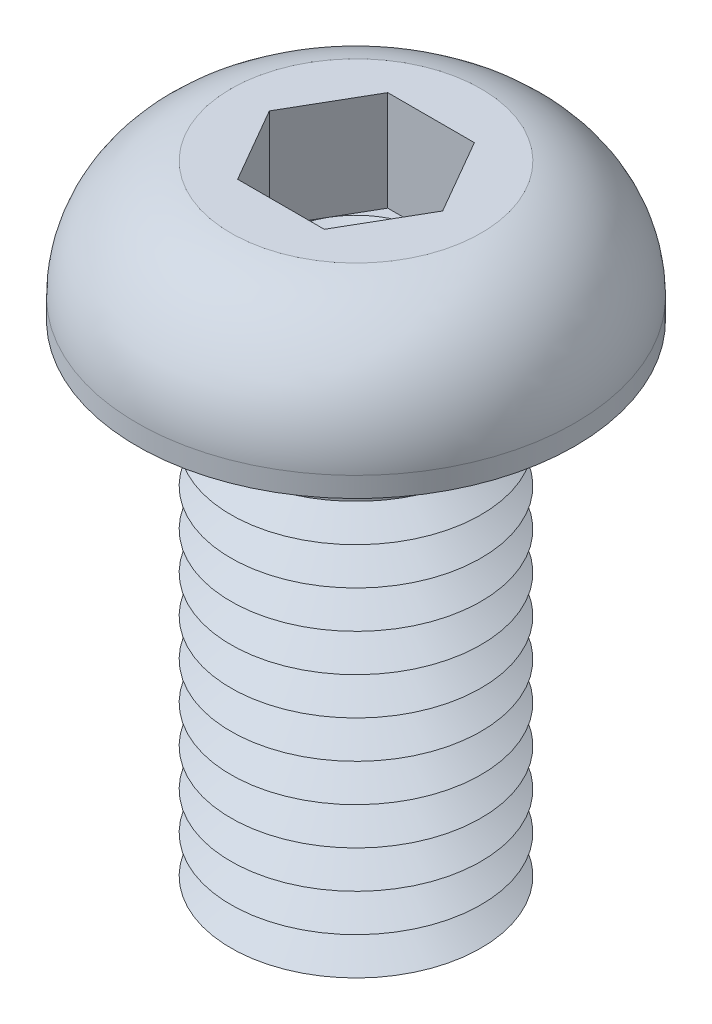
ISO-10303-21;
HEADER;
FILE_DESCRIPTION(('STEP AP214'),'2;1');
FILE_NAME('part.step','',(''),(''),'','','');
FILE_SCHEMA(('AUTOMOTIVE_DESIGN { 1 0 10303 214 1 1 1 1 }'));
ENDSEC;
DATA;
#1=APPLICATION_CONTEXT('core data for automotive mechanical design processes');
#2=APPLICATION_PROTOCOL_DEFINITION('international standard','automotive_design',2000,#1);
#3=PRODUCT_CONTEXT('',#1,'mechanical');
#4=PRODUCT('Part','Part','',(#3));
#5=PRODUCT_RELATED_PRODUCT_CATEGORY('part','',(#4));
#6=PRODUCT_DEFINITION_FORMATION('','',#4);
#7=PRODUCT_DEFINITION_CONTEXT('part definition',#1,'design');
#8=PRODUCT_DEFINITION('design','',#6,#7);
#9=PRODUCT_DEFINITION_SHAPE('','',#8);
#10=(LENGTH_UNIT() NAMED_UNIT(*) SI_UNIT(.MILLI.,.METRE.));
#11=(NAMED_UNIT(*) PLANE_ANGLE_UNIT() SI_UNIT($,.RADIAN.));
#12=(NAMED_UNIT(*) SI_UNIT($,.STERADIAN.) SOLID_ANGLE_UNIT());
#13=UNCERTAINTY_MEASURE_WITH_UNIT(LENGTH_MEASURE(1.E-05),#10,'distance_accuracy_value','');
#14=(GEOMETRIC_REPRESENTATION_CONTEXT(3) GLOBAL_UNCERTAINTY_ASSIGNED_CONTEXT((#13)) GLOBAL_UNIT_ASSIGNED_CONTEXT((#10,
#11,#12)) REPRESENTATION_CONTEXT('',''));
#15=CARTESIAN_POINT('',(0.,0.,0.));
#16=DIRECTION('',(0.,0.,1.));
#17=DIRECTION('',(1.,0.,0.));
#18=AXIS2_PLACEMENT_3D('',#15,#16,#17);
#19=CARTESIAN_POINT('',(0.,0.,0.));
#20=DIRECTION('',(0.,-1.,0.));
#21=DIRECTION('',(0.,0.,-1.));
#22=AXIS2_PLACEMENT_3D('',#19,#20,#21);
#23=TOROIDAL_SURFACE('',#22,5.75,0.75);
#24=CARTESIAN_POINT('',(0.,0.,-6.5));
#25=VERTEX_POINT('',#24);
#26=VERTEX_LOOP('',#25);
#27=FACE_BOUND('',#26,.T.);
#28=ADVANCED_FACE('P0_F12',(#27),#23,.T.);
#29=CLOSED_SHELL('',(#28));
#30=MANIFOLD_SOLID_BREP('P0_B1',#29);
#31=CARTESIAN_POINT('',(1.73205080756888,1.5,-3.));
#32=DIRECTION('',(0.,1.,0.));
#33=DIRECTION('',(0.,0.,1.));
#34=AXIS2_PLACEMENT_3D('',#31,#32,#33);
#35=PLANE('',#34);
#36=CARTESIAN_POINT('',(0.,1.5,0.));
#37=DIRECTION('',(0.,1.,0.));
#38=DIRECTION('',(0.,0.,1.));
#39=AXIS2_PLACEMENT_3D('',#36,#37,#38);
#40=CIRCLE('',#39,3.);
#41=CARTESIAN_POINT('',(0.,1.5,3.));
#42=VERTEX_POINT('',#41);
#43=CARTESIAN_POINT('',(2.59807621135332,1.5,1.5));
#44=VERTEX_POINT('',#43);
#45=EDGE_CURVE('P1_E93',#42,#44,#40,.T.);
#46=ORIENTED_EDGE('',*,*,#45,.F.);
#47=DIRECTION('',(1.,0.,0.));
#48=VECTOR('',#47,1.);
#49=CARTESIAN_POINT('',(-1.73205080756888,1.5,3.));
#50=LINE('',#49,#48);
#51=CARTESIAN_POINT('',(1.73205080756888,1.5,3.));
#52=VERTEX_POINT('',#51);
#53=EDGE_CURVE('P1_E116',#42,#52,#50,.T.);
#54=ORIENTED_EDGE('',*,*,#53,.T.);
#55=DIRECTION('',(0.5,0.,-0.866025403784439));
#56=VECTOR('',#55,1.);
#57=CARTESIAN_POINT('',(1.73205080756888,1.5,3.));
#58=LINE('',#57,#56);
#59=EDGE_CURVE('P1_E112',#52,#44,#58,.T.);
#60=ORIENTED_EDGE('',*,*,#59,.T.);
#61=EDGE_LOOP('',(#46,#54,#60));
#62=FACE_BOUND('',#61,.T.);
#63=ADVANCED_FACE('P1_F15',(#62),#35,.T.);
#64=CARTESIAN_POINT('',(0.,1.5,0.));
#65=DIRECTION('',(0.,1.,0.));
#66=DIRECTION('',(0.,0.,1.));
#67=AXIS2_PLACEMENT_3D('',#64,#65,#66);
#68=CIRCLE('',#67,3.);
#69=CARTESIAN_POINT('',(2.59807621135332,1.5,-1.5));
#70=VERTEX_POINT('',#69);
#71=EDGE_CURVE('P1_E10',#44,#70,#68,.T.);
#72=ORIENTED_EDGE('',*,*,#71,.F.);
#73=CARTESIAN_POINT('',(3.46410161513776,1.5,0.));
#74=VERTEX_POINT('',#73);
#75=EDGE_CURVE('P1_E104',#44,#74,#58,.T.);
#76=ORIENTED_EDGE('',*,*,#75,.T.);
#77=DIRECTION('',(-0.5,0.,-0.866025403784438));
#78=VECTOR('',#77,1.);
#79=CARTESIAN_POINT('',(3.46410161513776,1.5,0.));
#80=LINE('',#79,#78);
#81=EDGE_CURVE('P1_E107',#74,#70,#80,.T.);
#82=ORIENTED_EDGE('',*,*,#81,.T.);
#83=EDGE_LOOP('',(#72,#76,#82));
#84=FACE_BOUND('',#83,.T.);
#85=ADVANCED_FACE('P1_F103',(#84),#35,.T.);
#86=CARTESIAN_POINT('',(0.,1.5,-3.));
#87=VERTEX_POINT('',#86);
#88=EDGE_CURVE('P1_E24',#70,#87,#68,.T.);
#89=ORIENTED_EDGE('',*,*,#88,.F.);
#90=CARTESIAN_POINT('',(1.73205080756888,1.5,-3.));
#91=VERTEX_POINT('',#90);
#92=EDGE_CURVE('P1_E139',#70,#91,#80,.T.);
#93=ORIENTED_EDGE('',*,*,#92,.T.);
#94=DIRECTION('',(-1.,0.,0.));
#95=VECTOR('',#94,1.);
#96=CARTESIAN_POINT('',(1.73205080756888,1.5,-3.));
#97=LINE('',#96,#95);
#98=EDGE_CURVE('P1_E294',#91,#87,#97,.T.);
#99=ORIENTED_EDGE('',*,*,#98,.T.);
#100=EDGE_LOOP('',(#89,#93,#99));
#101=FACE_BOUND('',#100,.T.);
#102=ADVANCED_FACE('P1_F259',(#101),#35,.T.);
#103=CARTESIAN_POINT('',(-2.59807621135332,1.5,-1.5));
#104=VERTEX_POINT('',#103);
#105=EDGE_CURVE('P1_E289',#87,#104,#68,.T.);
#106=ORIENTED_EDGE('',*,*,#105,.F.);
#107=CARTESIAN_POINT('',(-1.73205080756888,1.5,-3.));
#108=VERTEX_POINT('',#107);
#109=EDGE_CURVE('P1_E298',#87,#108,#97,.T.);
#110=ORIENTED_EDGE('',*,*,#109,.T.);
#111=DIRECTION('',(-0.5,0.,0.866025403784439));
#112=VECTOR('',#111,1.);
#113=CARTESIAN_POINT('',(-1.73205080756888,1.5,-3.));
#114=LINE('',#113,#112);
#115=EDGE_CURVE('P1_E293',#108,#104,#114,.T.);
#116=ORIENTED_EDGE('',*,*,#115,.T.);
#117=EDGE_LOOP('',(#106,#110,#116));
#118=FACE_BOUND('',#117,.T.);
#119=ADVANCED_FACE('P1_F273',(#118),#35,.T.);
#120=CARTESIAN_POINT('',(-2.59807621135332,1.5,1.5));
#121=VERTEX_POINT('',#120);
#122=EDGE_CURVE('P1_E31',#104,#121,#68,.T.);
#123=ORIENTED_EDGE('',*,*,#122,.F.);
#124=CARTESIAN_POINT('',(-3.46410161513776,1.5,0.));
#125=VERTEX_POINT('',#124);
#126=EDGE_CURVE('P1_E285',#104,#125,#114,.T.);
#127=ORIENTED_EDGE('',*,*,#126,.T.);
#128=DIRECTION('',(0.5,0.,0.866025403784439));
#129=VECTOR('',#128,1.);
#130=CARTESIAN_POINT('',(-3.46410161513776,1.5,0.));
#131=LINE('',#130,#129);
#132=EDGE_CURVE('P1_E288',#125,#121,#131,.T.);
#133=ORIENTED_EDGE('',*,*,#132,.T.);
#134=EDGE_LOOP('',(#123,#127,#133));
#135=FACE_BOUND('',#134,.T.);
#136=ADVANCED_FACE('P1_F264',(#135),#35,.T.);
#137=CARTESIAN_POINT('',(0.,-18.5,0.));
#138=DIRECTION('',(0.,1.,0.));
#139=DIRECTION('',(0.,0.,1.));
#140=AXIS2_PLACEMENT_3D('',#137,#138,#139);
#141=CONICAL_SURFACE('',#140,3.70096189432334,1.0471975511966);
#142=CARTESIAN_POINT('',(0.,-17.75,0.));
#143=DIRECTION('',(0.,-1.,0.));
#144=DIRECTION('',(0.,0.,-1.));
#145=AXIS2_PLACEMENT_3D('',#142,#143,#144);
#146=CIRCLE('',#145,5.);
#147=CARTESIAN_POINT('',(0.,-17.75,-5.));
#148=VERTEX_POINT('',#147);
#149=EDGE_CURVE('P1_E221',#148,#148,#146,.T.);
#150=ORIENTED_EDGE('',*,*,#149,.T.);
#151=EDGE_LOOP('',(#150));
#152=FACE_BOUND('',#151,.T.);
#153=CARTESIAN_POINT('',(0.,-18.5,0.));
#154=DIRECTION('',(0.,-1.,0.));
#155=DIRECTION('',(0.,0.,-1.));
#156=AXIS2_PLACEMENT_3D('',#153,#154,#155);
#157=CIRCLE('',#156,3.70096189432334);
#158=CARTESIAN_POINT('',(0.,-18.5,-3.70096189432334));
#159=VERTEX_POINT('',#158);
#160=EDGE_CURVE('P1_E224',#159,#159,#157,.T.);
#161=ORIENTED_EDGE('',*,*,#160,.F.);
#162=EDGE_LOOP('',(#161));
#163=FACE_BOUND('',#162,.T.);
#164=ADVANCED_FACE('P1_F272',(#152,#163),#141,.T.);
#165=CARTESIAN_POINT('',(0.,-19.25,0.));
#166=DIRECTION('',(0.,-1.,0.));
#167=DIRECTION('',(0.,0.,-1.));
#168=AXIS2_PLACEMENT_3D('',#165,#166,#167);
#169=CONICAL_SURFACE('',#168,5.,1.0471975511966);
#170=ORIENTED_EDGE('',*,*,#160,.T.);
#171=EDGE_LOOP('',(#170));
#172=FACE_BOUND('',#171,.T.);
#173=CARTESIAN_POINT('',(0.,-19.25,0.));
#174=DIRECTION('',(0.,-1.,0.));
#175=DIRECTION('',(0.,0.,-1.));
#176=AXIS2_PLACEMENT_3D('',#173,#174,#175);
#177=CIRCLE('',#176,5.);
#178=CARTESIAN_POINT('',(0.,-19.25,-5.));
#179=VERTEX_POINT('',#178);
#180=EDGE_CURVE('P1_E227',#179,#179,#177,.T.);
#181=ORIENTED_EDGE('',*,*,#180,.F.);
#182=EDGE_LOOP('',(#181));
#183=FACE_BOUND('',#182,.T.);
#184=ADVANCED_FACE('P1_F279',(#172,#183),#169,.T.);
#185=CARTESIAN_POINT('',(0.,-20.,0.));
#186=DIRECTION('',(0.,1.,0.));
#187=DIRECTION('',(0.,0.,1.));
#188=AXIS2_PLACEMENT_3D('',#185,#186,#187);
#189=PLANE('',#188);
#190=CARTESIAN_POINT('',(0.,-20.,0.));
#191=DIRECTION('',(0.,-1.,0.));
#192=DIRECTION('',(0.,0.,-1.));
#193=AXIS2_PLACEMENT_3D('',#190,#191,#192);
#194=CIRCLE('',#193,3.70096189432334);
#195=CARTESIAN_POINT('',(0.,-20.,-3.70096189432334));
#196=VERTEX_POINT('',#195);
#197=EDGE_CURVE('P1_E230',#196,#196,#194,.T.);
#198=ORIENTED_EDGE('',*,*,#197,.T.);
#199=EDGE_LOOP('',(#198));
#200=FACE_BOUND('',#199,.T.);
#201=ADVANCED_FACE('P1_F357',(#200),#189,.F.);
#202=CARTESIAN_POINT('',(0.,-20.,0.));
#203=DIRECTION('',(0.,1.,0.));
#204=DIRECTION('',(0.,0.,1.));
#205=AXIS2_PLACEMENT_3D('',#202,#203,#204);
#206=CONICAL_SURFACE('',#205,3.70096189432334,1.0471975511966);
#207=ORIENTED_EDGE('',*,*,#180,.T.);
#208=EDGE_LOOP('',(#207));
#209=FACE_BOUND('',#208,.T.);
#210=ORIENTED_EDGE('',*,*,#197,.F.);
#211=EDGE_LOOP('',(#210));
#212=FACE_BOUND('',#211,.T.);
#213=ADVANCED_FACE('P1_F368',(#209,#212),#206,.T.);
#214=CARTESIAN_POINT('',(0.,-17.,0.));
#215=DIRECTION('',(0.,1.,0.));
#216=DIRECTION('',(0.,0.,1.));
#217=AXIS2_PLACEMENT_3D('',#214,#215,#216);
#218=CONICAL_SURFACE('',#217,3.70096189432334,1.0471975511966);
#219=CARTESIAN_POINT('',(0.,-16.25,0.));
#220=DIRECTION('',(0.,-1.,0.));
#221=DIRECTION('',(0.,0.,-1.));
#222=AXIS2_PLACEMENT_3D('',#219,#220,#221);
#223=CIRCLE('',#222,5.);
#224=CARTESIAN_POINT('',(0.,-16.25,-5.));
#225=VERTEX_POINT('',#224);
#226=EDGE_CURVE('P1_E215',#225,#225,#223,.T.);
#227=ORIENTED_EDGE('',*,*,#226,.T.);
#228=EDGE_LOOP('',(#227));
#229=FACE_BOUND('',#228,.T.);
#230=CARTESIAN_POINT('',(0.,-17.,0.));
#231=DIRECTION('',(0.,-1.,0.));
#232=DIRECTION('',(0.,0.,-1.));
#233=AXIS2_PLACEMENT_3D('',#230,#231,#232);
#234=CIRCLE('',#233,3.70096189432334);
#235=CARTESIAN_POINT('',(0.,-17.,-3.70096189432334));
#236=VERTEX_POINT('',#235);
#237=EDGE_CURVE('P1_E218',#236,#236,#234,.T.);
#238=ORIENTED_EDGE('',*,*,#237,.F.);
#239=EDGE_LOOP('',(#238));
#240=FACE_BOUND('',#239,.T.);
#241=ADVANCED_FACE('P1_F377',(#229,#240),#218,.T.);
#242=CARTESIAN_POINT('',(0.,-17.75,0.));
#243=DIRECTION('',(0.,-1.,0.));
#244=DIRECTION('',(0.,0.,-1.));
#245=AXIS2_PLACEMENT_3D('',#242,#243,#244);
#246=CONICAL_SURFACE('',#245,5.,1.0471975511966);
#247=ORIENTED_EDGE('',*,*,#237,.T.);
#248=EDGE_LOOP('',(#247));
#249=FACE_BOUND('',#248,.T.);
#250=ORIENTED_EDGE('',*,*,#149,.F.);
#251=EDGE_LOOP('',(#250));
#252=FACE_BOUND('',#251,.T.);
#253=ADVANCED_FACE('P1_F386',(#249,#252),#246,.T.);
#254=CARTESIAN_POINT('',(0.,-15.5,0.));
#255=DIRECTION('',(0.,1.,0.));
#256=DIRECTION('',(0.,0.,1.));
#257=AXIS2_PLACEMENT_3D('',#254,#255,#256);
#258=CONICAL_SURFACE('',#257,3.70096189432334,1.0471975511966);
#259=CARTESIAN_POINT('',(0.,-14.75,0.));
#260=DIRECTION('',(0.,-1.,0.));
#261=DIRECTION('',(0.,0.,-1.));
#262=AXIS2_PLACEMENT_3D('',#259,#260,#261);
#263=CIRCLE('',#262,5.);
#264=CARTESIAN_POINT('',(0.,-14.75,-5.));
#265=VERTEX_POINT('',#264);
#266=EDGE_CURVE('P1_E209',#265,#265,#263,.T.);
#267=ORIENTED_EDGE('',*,*,#266,.T.);
#268=EDGE_LOOP('',(#267));
#269=FACE_BOUND('',#268,.T.);
#270=CARTESIAN_POINT('',(0.,-15.5,0.));
#271=DIRECTION('',(0.,-1.,0.));
#272=DIRECTION('',(0.,0.,-1.));
#273=AXIS2_PLACEMENT_3D('',#270,#271,#272);
#274=CIRCLE('',#273,3.70096189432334);
#275=CARTESIAN_POINT('',(0.,-15.5,-3.70096189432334));
#276=VERTEX_POINT('',#275);
#277=EDGE_CURVE('P1_E212',#276,#276,#274,.T.);
#278=ORIENTED_EDGE('',*,*,#277,.F.);
#279=EDGE_LOOP('',(#278));
#280=FACE_BOUND('',#279,.T.);
#281=ADVANCED_FACE('P1_F396',(#269,#280),#258,.T.);
#282=CARTESIAN_POINT('',(0.,-16.25,0.));
#283=DIRECTION('',(0.,-1.,0.));
#284=DIRECTION('',(0.,0.,-1.));
#285=AXIS2_PLACEMENT_3D('',#282,#283,#284);
#286=CONICAL_SURFACE('',#285,5.,1.0471975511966);
#287=ORIENTED_EDGE('',*,*,#277,.T.);
#288=EDGE_LOOP('',(#287));
#289=FACE_BOUND('',#288,.T.);
#290=ORIENTED_EDGE('',*,*,#226,.F.);
#291=EDGE_LOOP('',(#290));
#292=FACE_BOUND('',#291,.T.);
#293=ADVANCED_FACE('P1_F406',(#289,#292),#286,.T.);
#294=CARTESIAN_POINT('',(0.,-14.,0.));
#295=DIRECTION('',(0.,1.,0.));
#296=DIRECTION('',(0.,0.,1.));
#297=AXIS2_PLACEMENT_3D('',#294,#295,#296);
#298=CONICAL_SURFACE('',#297,3.70096189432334,1.0471975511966);
#299=CARTESIAN_POINT('',(0.,-13.25,0.));
#300=DIRECTION('',(0.,-1.,0.));
#301=DIRECTION('',(0.,0.,-1.));
#302=AXIS2_PLACEMENT_3D('',#299,#300,#301);
#303=CIRCLE('',#302,5.);
#304=CARTESIAN_POINT('',(0.,-13.25,-5.));
#305=VERTEX_POINT('',#304);
#306=EDGE_CURVE('P1_E203',#305,#305,#303,.T.);
#307=ORIENTED_EDGE('',*,*,#306,.T.);
#308=EDGE_LOOP('',(#307));
#309=FACE_BOUND('',#308,.T.);
#310=CARTESIAN_POINT('',(0.,-14.,0.));
#311=DIRECTION('',(0.,-1.,0.));
#312=DIRECTION('',(0.,0.,-1.));
#313=AXIS2_PLACEMENT_3D('',#310,#311,#312);
#314=CIRCLE('',#313,3.70096189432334);
#315=CARTESIAN_POINT('',(0.,-14.,-3.70096189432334));
#316=VERTEX_POINT('',#315);
#317=EDGE_CURVE('P1_E206',#316,#316,#314,.T.);
#318=ORIENTED_EDGE('',*,*,#317,.F.);
#319=EDGE_LOOP('',(#318));
#320=FACE_BOUND('',#319,.T.);
#321=ADVANCED_FACE('P1_F416',(#309,#320),#298,.T.);
#322=CARTESIAN_POINT('',(0.,-14.75,0.));
#323=DIRECTION('',(0.,-1.,0.));
#324=DIRECTION('',(0.,0.,-1.));
#325=AXIS2_PLACEMENT_3D('',#322,#323,#324);
#326=CONICAL_SURFACE('',#325,5.,1.0471975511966);
#327=ORIENTED_EDGE('',*,*,#317,.T.);
#328=EDGE_LOOP('',(#327));
#329=FACE_BOUND('',#328,.T.);
#330=ORIENTED_EDGE('',*,*,#266,.F.);
#331=EDGE_LOOP('',(#330));
#332=FACE_BOUND('',#331,.T.);
#333=ADVANCED_FACE('P1_F426',(#329,#332),#326,.T.);
#334=CARTESIAN_POINT('',(0.,-12.5,0.));
#335=DIRECTION('',(0.,1.,0.));
#336=DIRECTION('',(0.,0.,1.));
#337=AXIS2_PLACEMENT_3D('',#334,#335,#336);
#338=CONICAL_SURFACE('',#337,3.70096189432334,1.0471975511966);
#339=CARTESIAN_POINT('',(0.,-11.75,0.));
#340=DIRECTION('',(0.,-1.,0.));
#341=DIRECTION('',(0.,0.,-1.));
#342=AXIS2_PLACEMENT_3D('',#339,#340,#341);
#343=CIRCLE('',#342,5.);
#344=CARTESIAN_POINT('',(0.,-11.75,-5.));
#345=VERTEX_POINT('',#344);
#346=EDGE_CURVE('P1_E197',#345,#345,#343,.T.);
#347=ORIENTED_EDGE('',*,*,#346,.T.);
#348=EDGE_LOOP('',(#347));
#349=FACE_BOUND('',#348,.T.);
#350=CARTESIAN_POINT('',(0.,-12.5,0.));
#351=DIRECTION('',(0.,-1.,0.));
#352=DIRECTION('',(0.,0.,-1.));
#353=AXIS2_PLACEMENT_3D('',#350,#351,#352);
#354=CIRCLE('',#353,3.70096189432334);
#355=CARTESIAN_POINT('',(0.,-12.5,-3.70096189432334));
#356=VERTEX_POINT('',#355);
#357=EDGE_CURVE('P1_E200',#356,#356,#354,.T.);
#358=ORIENTED_EDGE('',*,*,#357,.F.);
#359=EDGE_LOOP('',(#358));
#360=FACE_BOUND('',#359,.T.);
#361=ADVANCED_FACE('P1_F436',(#349,#360),#338,.T.);
#362=CARTESIAN_POINT('',(0.,-13.25,0.));
#363=DIRECTION('',(0.,-1.,0.));
#364=DIRECTION('',(0.,0.,-1.));
#365=AXIS2_PLACEMENT_3D('',#362,#363,#364);
#366=CONICAL_SURFACE('',#365,5.,1.0471975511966);
#367=ORIENTED_EDGE('',*,*,#357,.T.);
#368=EDGE_LOOP('',(#367));
#369=FACE_BOUND('',#368,.T.);
#370=ORIENTED_EDGE('',*,*,#306,.F.);
#371=EDGE_LOOP('',(#370));
#372=FACE_BOUND('',#371,.T.);
#373=ADVANCED_FACE('P1_F446',(#369,#372),#366,.T.);
#374=CARTESIAN_POINT('',(0.,-11.,0.));
#375=DIRECTION('',(0.,1.,0.));
#376=DIRECTION('',(0.,0.,1.));
#377=AXIS2_PLACEMENT_3D('',#374,#375,#376);
#378=CONICAL_SURFACE('',#377,3.70096189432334,1.0471975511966);
#379=CARTESIAN_POINT('',(0.,-10.25,0.));
#380=DIRECTION('',(0.,-1.,0.));
#381=DIRECTION('',(0.,0.,-1.));
#382=AXIS2_PLACEMENT_3D('',#379,#380,#381);
#383=CIRCLE('',#382,5.);
#384=CARTESIAN_POINT('',(0.,-10.25,-5.));
#385=VERTEX_POINT('',#384);
#386=EDGE_CURVE('P1_E191',#385,#385,#383,.T.);
#387=ORIENTED_EDGE('',*,*,#386,.T.);
#388=EDGE_LOOP('',(#387));
#389=FACE_BOUND('',#388,.T.);
#390=CARTESIAN_POINT('',(0.,-11.,0.));
#391=DIRECTION('',(0.,-1.,0.));
#392=DIRECTION('',(0.,0.,-1.));
#393=AXIS2_PLACEMENT_3D('',#390,#391,#392);
#394=CIRCLE('',#393,3.70096189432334);
#395=CARTESIAN_POINT('',(0.,-11.,-3.70096189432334));
#396=VERTEX_POINT('',#395);
#397=EDGE_CURVE('P1_E194',#396,#396,#394,.T.);
#398=ORIENTED_EDGE('',*,*,#397,.F.);
#399=EDGE_LOOP('',(#398));
#400=FACE_BOUND('',#399,.T.);
#401=ADVANCED_FACE('P1_F456',(#389,#400),#378,.T.);
#402=CARTESIAN_POINT('',(0.,-11.75,0.));
#403=DIRECTION('',(0.,-1.,0.));
#404=DIRECTION('',(0.,0.,-1.));
#405=AXIS2_PLACEMENT_3D('',#402,#403,#404);
#406=CONICAL_SURFACE('',#405,5.,1.0471975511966);
#407=ORIENTED_EDGE('',*,*,#397,.T.);
#408=EDGE_LOOP('',(#407));
#409=FACE_BOUND('',#408,.T.);
#410=ORIENTED_EDGE('',*,*,#346,.F.);
#411=EDGE_LOOP('',(#410));
#412=FACE_BOUND('',#411,.T.);
#413=ADVANCED_FACE('P1_F466',(#409,#412),#406,.T.);
#414=CARTESIAN_POINT('',(0.,-9.5,0.));
#415=DIRECTION('',(0.,1.,0.));
#416=DIRECTION('',(0.,0.,1.));
#417=AXIS2_PLACEMENT_3D('',#414,#415,#416);
#418=CONICAL_SURFACE('',#417,3.70096189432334,1.0471975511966);
#419=CARTESIAN_POINT('',(0.,-8.75,0.));
#420=DIRECTION('',(0.,-1.,0.));
#421=DIRECTION('',(0.,0.,-1.));
#422=AXIS2_PLACEMENT_3D('',#419,#420,#421);
#423=CIRCLE('',#422,5.);
#424=CARTESIAN_POINT('',(0.,-8.75,-5.));
#425=VERTEX_POINT('',#424);
#426=EDGE_CURVE('P1_E185',#425,#425,#423,.T.);
#427=ORIENTED_EDGE('',*,*,#426,.T.);
#428=EDGE_LOOP('',(#427));
#429=FACE_BOUND('',#428,.T.);
#430=CARTESIAN_POINT('',(0.,-9.5,0.));
#431=DIRECTION('',(0.,-1.,0.));
#432=DIRECTION('',(0.,0.,-1.));
#433=AXIS2_PLACEMENT_3D('',#430,#431,#432);
#434=CIRCLE('',#433,3.70096189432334);
#435=CARTESIAN_POINT('',(0.,-9.5,-3.70096189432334));
#436=VERTEX_POINT('',#435);
#437=EDGE_CURVE('P1_E188',#436,#436,#434,.T.);
#438=ORIENTED_EDGE('',*,*,#437,.F.);
#439=EDGE_LOOP('',(#438));
#440=FACE_BOUND('',#439,.T.);
#441=ADVANCED_FACE('P1_F476',(#429,#440),#418,.T.);
#442=CARTESIAN_POINT('',(0.,-10.25,0.));
#443=DIRECTION('',(0.,-1.,0.));
#444=DIRECTION('',(0.,0.,-1.));
#445=AXIS2_PLACEMENT_3D('',#442,#443,#444);
#446=CONICAL_SURFACE('',#445,5.,1.0471975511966);
#447=ORIENTED_EDGE('',*,*,#437,.T.);
#448=EDGE_LOOP('',(#447));
#449=FACE_BOUND('',#448,.T.);
#450=ORIENTED_EDGE('',*,*,#386,.F.);
#451=EDGE_LOOP('',(#450));
#452=FACE_BOUND('',#451,.T.);
#453=ADVANCED_FACE('P1_F486',(#449,#452),#446,.T.);
#454=CARTESIAN_POINT('',(0.,-8.,0.));
#455=DIRECTION('',(0.,1.,0.));
#456=DIRECTION('',(0.,0.,1.));
#457=AXIS2_PLACEMENT_3D('',#454,#455,#456);
#458=CONICAL_SURFACE('',#457,3.70096189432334,1.0471975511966);
#459=CARTESIAN_POINT('',(0.,-7.25,0.));
#460=DIRECTION('',(0.,-1.,0.));
#461=DIRECTION('',(0.,0.,-1.));
#462=AXIS2_PLACEMENT_3D('',#459,#460,#461);
#463=CIRCLE('',#462,5.);
#464=CARTESIAN_POINT('',(0.,-7.25,-5.));
#465=VERTEX_POINT('',#464);
#466=EDGE_CURVE('P1_E179',#465,#465,#463,.T.);
#467=ORIENTED_EDGE('',*,*,#466,.T.);
#468=EDGE_LOOP('',(#467));
#469=FACE_BOUND('',#468,.T.);
#470=CARTESIAN_POINT('',(0.,-8.,0.));
#471=DIRECTION('',(0.,-1.,0.));
#472=DIRECTION('',(0.,0.,-1.));
#473=AXIS2_PLACEMENT_3D('',#470,#471,#472);
#474=CIRCLE('',#473,3.70096189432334);
#475=CARTESIAN_POINT('',(0.,-8.,-3.70096189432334));
#476=VERTEX_POINT('',#475);
#477=EDGE_CURVE('P1_E182',#476,#476,#474,.T.);
#478=ORIENTED_EDGE('',*,*,#477,.F.);
#479=EDGE_LOOP('',(#478));
#480=FACE_BOUND('',#479,.T.);
#481=ADVANCED_FACE('P1_F496',(#469,#480),#458,.T.);
#482=CARTESIAN_POINT('',(0.,-8.75,0.));
#483=DIRECTION('',(0.,-1.,0.));
#484=DIRECTION('',(0.,0.,-1.));
#485=AXIS2_PLACEMENT_3D('',#482,#483,#484);
#486=CONICAL_SURFACE('',#485,5.,1.0471975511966);
#487=ORIENTED_EDGE('',*,*,#477,.T.);
#488=EDGE_LOOP('',(#487));
#489=FACE_BOUND('',#488,.T.);
#490=ORIENTED_EDGE('',*,*,#426,.F.);
#491=EDGE_LOOP('',(#490));
#492=FACE_BOUND('',#491,.T.);
#493=ADVANCED_FACE('P1_F506',(#489,#492),#486,.T.);
#494=CARTESIAN_POINT('',(0.,-6.5,0.));
#495=DIRECTION('',(0.,1.,0.));
#496=DIRECTION('',(0.,0.,1.));
#497=AXIS2_PLACEMENT_3D('',#494,#495,#496);
#498=CONICAL_SURFACE('',#497,3.70096189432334,1.0471975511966);
#499=CARTESIAN_POINT('',(0.,-5.75,0.));
#500=DIRECTION('',(0.,-1.,0.));
#501=DIRECTION('',(0.,0.,-1.));
#502=AXIS2_PLACEMENT_3D('',#499,#500,#501);
#503=CIRCLE('',#502,5.);
#504=CARTESIAN_POINT('',(0.,-5.75,-5.));
#505=VERTEX_POINT('',#504);
#506=EDGE_CURVE('P1_E173',#505,#505,#503,.T.);
#507=ORIENTED_EDGE('',*,*,#506,.T.);
#508=EDGE_LOOP('',(#507));
#509=FACE_BOUND('',#508,.T.);
#510=CARTESIAN_POINT('',(0.,-6.5,0.));
#511=DIRECTION('',(0.,-1.,0.));
#512=DIRECTION('',(0.,0.,-1.));
#513=AXIS2_PLACEMENT_3D('',#510,#511,#512);
#514=CIRCLE('',#513,3.70096189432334);
#515=CARTESIAN_POINT('',(0.,-6.5,-3.70096189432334));
#516=VERTEX_POINT('',#515);
#517=EDGE_CURVE('P1_E176',#516,#516,#514,.T.);
#518=ORIENTED_EDGE('',*,*,#517,.F.);
#519=EDGE_LOOP('',(#518));
#520=FACE_BOUND('',#519,.T.);
#521=ADVANCED_FACE('P1_F516',(#509,#520),#498,.T.);
#522=CARTESIAN_POINT('',(0.,-7.25,0.));
#523=DIRECTION('',(0.,-1.,0.));
#524=DIRECTION('',(0.,0.,-1.));
#525=AXIS2_PLACEMENT_3D('',#522,#523,#524);
#526=CONICAL_SURFACE('',#525,5.,1.0471975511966);
#527=ORIENTED_EDGE('',*,*,#517,.T.);
#528=EDGE_LOOP('',(#527));
#529=FACE_BOUND('',#528,.T.);
#530=ORIENTED_EDGE('',*,*,#466,.F.);
#531=EDGE_LOOP('',(#530));
#532=FACE_BOUND('',#531,.T.);
#533=ADVANCED_FACE('P1_F526',(#529,#532),#526,.T.);
#534=CARTESIAN_POINT('',(0.,-5.,0.));
#535=DIRECTION('',(0.,1.,0.));
#536=DIRECTION('',(0.,0.,1.));
#537=AXIS2_PLACEMENT_3D('',#534,#535,#536);
#538=CONICAL_SURFACE('',#537,3.70096189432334,1.0471975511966);
#539=CARTESIAN_POINT('',(0.,-4.25,0.));
#540=DIRECTION('',(0.,-1.,0.));
#541=DIRECTION('',(0.,0.,-1.));
#542=AXIS2_PLACEMENT_3D('',#539,#540,#541);
#543=CIRCLE('',#542,5.);
#544=CARTESIAN_POINT('',(0.,-4.25,-5.));
#545=VERTEX_POINT('',#544);
#546=EDGE_CURVE('P1_E164',#545,#545,#543,.T.);
#547=ORIENTED_EDGE('',*,*,#546,.T.);
#548=EDGE_LOOP('',(#547));
#549=FACE_BOUND('',#548,.T.);
#550=CARTESIAN_POINT('',(0.,-5.,0.));
#551=DIRECTION('',(0.,-1.,0.));
#552=DIRECTION('',(0.,0.,-1.));
#553=AXIS2_PLACEMENT_3D('',#550,#551,#552);
#554=CIRCLE('',#553,3.70096189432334);
#555=CARTESIAN_POINT('',(0.,-5.,-3.70096189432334));
#556=VERTEX_POINT('',#555);
#557=EDGE_CURVE('P1_E170',#556,#556,#554,.T.);
#558=ORIENTED_EDGE('',*,*,#557,.F.);
#559=EDGE_LOOP('',(#558));
#560=FACE_BOUND('',#559,.T.);
#561=ADVANCED_FACE('P1_F536',(#549,#560),#538,.T.);
#562=CARTESIAN_POINT('',(0.,-5.75,0.));
#563=DIRECTION('',(0.,-1.,0.));
#564=DIRECTION('',(0.,0.,-1.));
#565=AXIS2_PLACEMENT_3D('',#562,#563,#564);
#566=CONICAL_SURFACE('',#565,5.,1.0471975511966);
#567=ORIENTED_EDGE('',*,*,#557,.T.);
#568=EDGE_LOOP('',(#567));
#569=FACE_BOUND('',#568,.T.);
#570=ORIENTED_EDGE('',*,*,#506,.F.);
#571=EDGE_LOOP('',(#570));
#572=FACE_BOUND('',#571,.T.);
#573=ADVANCED_FACE('P1_F546',(#569,#572),#566,.T.);
#574=CARTESIAN_POINT('',(0.,-3.5,0.));
#575=DIRECTION('',(0.,1.,0.));
#576=DIRECTION('',(0.,0.,1.));
#577=AXIS2_PLACEMENT_3D('',#574,#575,#576);
#578=CONICAL_SURFACE('',#577,3.70096189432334,1.0471975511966);
#579=CARTESIAN_POINT('',(0.,-2.75,0.));
#580=DIRECTION('',(0.,-1.,0.));
#581=DIRECTION('',(0.,0.,-1.));
#582=AXIS2_PLACEMENT_3D('',#579,#580,#581);
#583=CIRCLE('',#582,5.);
#584=CARTESIAN_POINT('',(0.,-2.75,-5.));
#585=VERTEX_POINT('',#584);
#586=EDGE_CURVE('P1_E167',#585,#585,#583,.T.);
#587=ORIENTED_EDGE('',*,*,#586,.T.);
#588=EDGE_LOOP('',(#587));
#589=FACE_BOUND('',#588,.T.);
#590=CARTESIAN_POINT('',(0.,-3.5,0.));
#591=DIRECTION('',(0.,-1.,0.));
#592=DIRECTION('',(0.,0.,-1.));
#593=AXIS2_PLACEMENT_3D('',#590,#591,#592);
#594=CIRCLE('',#593,3.70096189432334);
#595=CARTESIAN_POINT('',(0.,-3.5,-3.70096189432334));
#596=VERTEX_POINT('',#595);
#597=EDGE_CURVE('P1_E161',#596,#596,#594,.T.);
#598=ORIENTED_EDGE('',*,*,#597,.F.);
#599=EDGE_LOOP('',(#598));
#600=FACE_BOUND('',#599,.T.);
#601=ADVANCED_FACE('P1_F556',(#589,#600),#578,.T.);
#602=CARTESIAN_POINT('',(0.,-4.25,0.));
#603=DIRECTION('',(0.,-1.,0.));
#604=DIRECTION('',(0.,0.,-1.));
#605=AXIS2_PLACEMENT_3D('',#602,#603,#604);
#606=CONICAL_SURFACE('',#605,5.,1.0471975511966);
#607=ORIENTED_EDGE('',*,*,#597,.T.);
#608=EDGE_LOOP('',(#607));
#609=FACE_BOUND('',#608,.T.);
#610=ORIENTED_EDGE('',*,*,#546,.F.);
#611=EDGE_LOOP('',(#610));
#612=FACE_BOUND('',#611,.T.);
#613=ADVANCED_FACE('P1_F566',(#609,#612),#606,.T.);
#614=CARTESIAN_POINT('',(0.,-20.,0.));
#615=DIRECTION('',(0.,1.,0.));
#616=DIRECTION('',(0.,0.,1.));
#617=AXIS2_PLACEMENT_3D('',#614,#615,#616);
#618=CYLINDRICAL_SURFACE('',#617,5.);
#619=CARTESIAN_POINT('',(0.,0.,0.));
#620=DIRECTION('',(0.,-1.,0.));
#621=DIRECTION('',(1.,0.,0.));
#622=AXIS2_PLACEMENT_3D('',#619,#620,#621);
#623=CIRCLE('',#622,5.);
#624=CARTESIAN_POINT('',(5.,0.,0.));
#625=VERTEX_POINT('',#624);
#626=EDGE_CURVE('P1_E141',#625,#625,#623,.F.);
#627=ORIENTED_EDGE('',*,*,#626,.F.);
#628=EDGE_LOOP('',(#627));
#629=FACE_BOUND('',#628,.T.);
#630=ORIENTED_EDGE('',*,*,#586,.F.);
#631=EDGE_LOOP('',(#630));
#632=FACE_BOUND('',#631,.T.);
#633=ADVANCED_FACE('P1_F17',(#629,#632),#618,.T.);
#634=CARTESIAN_POINT('',(0.,0.,0.));
#635=DIRECTION('',(0.,-1.,0.));
#636=DIRECTION('',(0.,0.,-1.));
#637=AXIS2_PLACEMENT_3D('',#634,#635,#636);
#638=TOROIDAL_SURFACE('',#637,5.75,0.749999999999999);
#639=ORIENTED_EDGE('',*,*,#626,.T.);
#640=EDGE_LOOP('',(#639));
#641=FACE_BOUND('',#640,.T.);
#642=CARTESIAN_POINT('',(0.,0.,0.));
#643=DIRECTION('',(0.,1.,0.));
#644=DIRECTION('',(-1.,0.,0.));
#645=AXIS2_PLACEMENT_3D('',#642,#643,#644);
#646=CIRCLE('',#645,6.5);
#647=CARTESIAN_POINT('',(-6.5,0.,0.));
#648=VERTEX_POINT('',#647);
#649=EDGE_CURVE('P1_E151',#648,#648,#646,.F.);
#650=ORIENTED_EDGE('',*,*,#649,.T.);
#651=EDGE_LOOP('',(#650));
#652=FACE_BOUND('',#651,.T.);
#653=ADVANCED_FACE('P1_F235',(#641,#652),#638,.F.);
#654=CARTESIAN_POINT('',(5.,5.5,0.));
#655=DIRECTION('',(0.,-1.,0.));
#656=DIRECTION('',(1.,0.,0.));
#657=AXIS2_PLACEMENT_3D('',#654,#655,#656);
#658=PLANE('',#657);
#659=DIRECTION('',(-1.,0.,0.));
#660=VECTOR('',#659,1.);
#661=CARTESIAN_POINT('',(1.73205080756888,5.5,-3.));
#662=LINE('',#661,#660);
#663=CARTESIAN_POINT('',(1.73205080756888,5.5,-3.));
#664=VERTEX_POINT('',#663);
#665=CARTESIAN_POINT('',(-1.73205080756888,5.5,-3.));
#666=VERTEX_POINT('',#665);
#667=EDGE_CURVE('P1_E125',#664,#666,#662,.T.);
#668=ORIENTED_EDGE('',*,*,#667,.F.);
#669=DIRECTION('',(-0.5,0.,-0.866025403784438));
#670=VECTOR('',#669,1.);
#671=CARTESIAN_POINT('',(3.46410161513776,5.5,0.));
#672=LINE('',#671,#670);
#673=CARTESIAN_POINT('',(3.46410161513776,5.5,0.));
#674=VERTEX_POINT('',#673);
#675=EDGE_CURVE('P1_E39',#674,#664,#672,.T.);
#676=ORIENTED_EDGE('',*,*,#675,.F.);
#677=DIRECTION('',(0.5,0.,-0.866025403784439));
#678=VECTOR('',#677,1.);
#679=CARTESIAN_POINT('',(1.73205080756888,5.5,3.));
#680=LINE('',#679,#678);
#681=CARTESIAN_POINT('',(1.73205080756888,5.5,3.));
#682=VERTEX_POINT('',#681);
#683=EDGE_CURVE('P1_E137',#682,#674,#680,.T.);
#684=ORIENTED_EDGE('',*,*,#683,.F.);
#685=DIRECTION('',(1.,0.,0.));
#686=VECTOR('',#685,1.);
#687=CARTESIAN_POINT('',(-1.73205080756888,5.5,3.));
#688=LINE('',#687,#686);
#689=CARTESIAN_POINT('',(-1.73205080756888,5.5,3.));
#690=VERTEX_POINT('',#689);
#691=EDGE_CURVE('P1_E134',#690,#682,#688,.T.);
#692=ORIENTED_EDGE('',*,*,#691,.F.);
#693=DIRECTION('',(0.5,0.,0.866025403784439));
#694=VECTOR('',#693,1.);
#695=CARTESIAN_POINT('',(-3.46410161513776,5.5,0.));
#696=LINE('',#695,#694);
#697=CARTESIAN_POINT('',(-3.46410161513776,5.5,0.));
#698=VERTEX_POINT('',#697);
#699=EDGE_CURVE('P1_E131',#698,#690,#696,.T.);
#700=ORIENTED_EDGE('',*,*,#699,.F.);
#701=DIRECTION('',(-0.5,0.,0.866025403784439));
#702=VECTOR('',#701,1.);
#703=CARTESIAN_POINT('',(-1.73205080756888,5.5,-3.));
#704=LINE('',#703,#702);
#705=EDGE_CURVE('P1_E128',#666,#698,#704,.T.);
#706=ORIENTED_EDGE('',*,*,#705,.F.);
#707=EDGE_LOOP('',(#668,#676,#684,#692,#700,#706));
#708=FACE_BOUND('',#707,.T.);
#709=CARTESIAN_POINT('',(0.,5.5,0.));
#710=DIRECTION('',(0.,1.,0.));
#711=DIRECTION('',(-1.,0.,0.));
#712=AXIS2_PLACEMENT_3D('',#709,#710,#711);
#713=CIRCLE('',#712,5.);
#714=CARTESIAN_POINT('',(-5.,5.5,0.));
#715=VERTEX_POINT('',#714);
#716=EDGE_CURVE('P1_E152',#715,#715,#713,.T.);
#717=ORIENTED_EDGE('',*,*,#716,.T.);
#718=EDGE_LOOP('',(#717));
#719=FACE_BOUND('',#718,.T.);
#720=ADVANCED_FACE('P1_F313',(#708,#719),#658,.F.);
#721=CARTESIAN_POINT('',(0.,0.8,0.));
#722=DIRECTION('',(0.,1.,0.));
#723=DIRECTION('',(-1.,0.,0.));
#724=AXIS2_PLACEMENT_3D('',#721,#722,#723);
#725=DEGENERATE_TOROIDAL_SURFACE('',#724,3.92966666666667,4.82033333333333,.T.);
#726=ORIENTED_EDGE('',*,*,#716,.F.);
#727=EDGE_LOOP('',(#726));
#728=FACE_BOUND('',#727,.T.);
#729=CARTESIAN_POINT('',(0.,0.799999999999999,0.));
#730=DIRECTION('',(0.,1.,0.));
#731=DIRECTION('',(-1.,0.,0.));
#732=AXIS2_PLACEMENT_3D('',#729,#730,#731);
#733=CIRCLE('',#732,8.75);
#734=CARTESIAN_POINT('',(-8.75,0.799999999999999,0.));
#735=VERTEX_POINT('',#734);
#736=EDGE_CURVE('P1_E155',#735,#735,#733,.T.);
#737=ORIENTED_EDGE('',*,*,#736,.T.);
#738=EDGE_LOOP('',(#737));
#739=FACE_BOUND('',#738,.T.);
#740=ADVANCED_FACE('P1_F249',(#728,#739),#725,.T.);
#741=CARTESIAN_POINT('',(0.,5.5,0.));
#742=DIRECTION('',(0.,1.,0.));
#743=DIRECTION('',(-1.,0.,0.));
#744=AXIS2_PLACEMENT_3D('',#741,#742,#743);
#745=CYLINDRICAL_SURFACE('',#744,8.75);
#746=ORIENTED_EDGE('',*,*,#736,.F.);
#747=EDGE_LOOP('',(#746));
#748=FACE_BOUND('',#747,.T.);
#749=CARTESIAN_POINT('',(0.,0.,0.));
#750=DIRECTION('',(0.,1.,0.));
#751=DIRECTION('',(-1.,0.,0.));
#752=AXIS2_PLACEMENT_3D('',#749,#750,#751);
#753=CIRCLE('',#752,8.75);
#754=CARTESIAN_POINT('',(-8.75,0.,0.));
#755=VERTEX_POINT('',#754);
#756=EDGE_CURVE('P1_E158',#755,#755,#753,.T.);
#757=ORIENTED_EDGE('',*,*,#756,.T.);
#758=EDGE_LOOP('',(#757));
#759=FACE_BOUND('',#758,.T.);
#760=ADVANCED_FACE('P1_F240',(#748,#759),#745,.T.);
#761=CARTESIAN_POINT('',(0.,0.,0.));
#762=DIRECTION('',(0.,1.,0.));
#763=DIRECTION('',(-1.,0.,0.));
#764=AXIS2_PLACEMENT_3D('',#761,#762,#763);
#765=PLANE('',#764);
#766=ORIENTED_EDGE('',*,*,#756,.F.);
#767=EDGE_LOOP('',(#766));
#768=FACE_BOUND('',#767,.T.);
#769=ORIENTED_EDGE('',*,*,#649,.F.);
#770=EDGE_LOOP('',(#769));
#771=FACE_BOUND('',#770,.T.);
#772=ADVANCED_FACE('P1_F237',(#768,#771),#765,.F.);
#773=CARTESIAN_POINT('',(3.46410161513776,1.5,0.));
#774=DIRECTION('',(0.866025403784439,0.,-0.5));
#775=DIRECTION('',(-0.5,0.,-0.866025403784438));
#776=AXIS2_PLACEMENT_3D('',#773,#774,#775);
#777=PLANE('',#776);
#778=ORIENTED_EDGE('',*,*,#675,.T.);
#779=DIRECTION('',(0.,1.,0.));
#780=VECTOR('',#779,1.);
#781=CARTESIAN_POINT('',(1.73205080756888,1.5,-3.));
#782=LINE('',#781,#780);
#783=EDGE_CURVE('P1_E118',#91,#664,#782,.T.);
#784=ORIENTED_EDGE('',*,*,#783,.F.);
#785=ORIENTED_EDGE('',*,*,#92,.F.);
#786=ORIENTED_EDGE('',*,*,#81,.F.);
#787=DIRECTION('',(0.,1.,0.));
#788=VECTOR('',#787,1.);
#789=CARTESIAN_POINT('',(3.46410161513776,1.5,0.));
#790=LINE('',#789,#788);
#791=EDGE_CURVE('P1_E113',#74,#674,#790,.T.);
#792=ORIENTED_EDGE('',*,*,#791,.T.);
#793=EDGE_LOOP('',(#778,#784,#785,#786,#792));
#794=FACE_BOUND('',#793,.T.);
#795=ADVANCED_FACE('P1_F239',(#794),#777,.F.);
#796=CARTESIAN_POINT('',(1.73205080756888,1.5,3.));
#797=DIRECTION('',(0.866025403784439,0.,0.5));
#798=DIRECTION('',(0.5,0.,-0.866025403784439));
#799=AXIS2_PLACEMENT_3D('',#796,#797,#798);
#800=PLANE('',#799);
#801=ORIENTED_EDGE('',*,*,#683,.T.);
#802=ORIENTED_EDGE('',*,*,#791,.F.);
#803=ORIENTED_EDGE('',*,*,#75,.F.);
#804=ORIENTED_EDGE('',*,*,#59,.F.);
#805=DIRECTION('',(0.,1.,0.));
#806=VECTOR('',#805,1.);
#807=CARTESIAN_POINT('',(1.73205080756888,1.5,3.));
#808=LINE('',#807,#806);
#809=EDGE_CURVE('P1_E142',#52,#682,#808,.T.);
#810=ORIENTED_EDGE('',*,*,#809,.T.);
#811=EDGE_LOOP('',(#801,#802,#803,#804,#810));
#812=FACE_BOUND('',#811,.T.);
#813=ADVANCED_FACE('P1_F111',(#812),#800,.F.);
#814=CARTESIAN_POINT('',(-1.73205080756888,1.5,3.));
#815=DIRECTION('',(0.,0.,1.));
#816=DIRECTION('',(1.,0.,0.));
#817=AXIS2_PLACEMENT_3D('',#814,#815,#816);
#818=PLANE('',#817);
#819=ORIENTED_EDGE('',*,*,#691,.T.);
#820=ORIENTED_EDGE('',*,*,#809,.F.);
#821=ORIENTED_EDGE('',*,*,#53,.F.);
#822=CARTESIAN_POINT('',(-1.73205080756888,1.5,3.));
#823=VERTEX_POINT('',#822);
#824=EDGE_CURVE('P1_E114',#823,#42,#50,.T.);
#825=ORIENTED_EDGE('',*,*,#824,.F.);
#826=DIRECTION('',(0.,1.,0.));
#827=VECTOR('',#826,1.);
#828=CARTESIAN_POINT('',(-1.73205080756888,1.5,3.));
#829=LINE('',#828,#827);
#830=EDGE_CURVE('P1_E144',#823,#690,#829,.T.);
#831=ORIENTED_EDGE('',*,*,#830,.T.);
#832=EDGE_LOOP('',(#819,#820,#821,#825,#831));
#833=FACE_BOUND('',#832,.T.);
#834=ADVANCED_FACE('P1_F308',(#833),#818,.F.);
#835=CARTESIAN_POINT('',(-3.46410161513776,1.5,0.));
#836=DIRECTION('',(-0.866025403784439,0.,0.5));
#837=DIRECTION('',(0.5,0.,0.866025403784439));
#838=AXIS2_PLACEMENT_3D('',#835,#836,#837);
#839=PLANE('',#838);
#840=ORIENTED_EDGE('',*,*,#699,.T.);
#841=ORIENTED_EDGE('',*,*,#830,.F.);
#842=EDGE_CURVE('P1_E300',#121,#823,#131,.T.);
#843=ORIENTED_EDGE('',*,*,#842,.F.);
#844=ORIENTED_EDGE('',*,*,#132,.F.);
#845=DIRECTION('',(0.,1.,0.));
#846=VECTOR('',#845,1.);
#847=CARTESIAN_POINT('',(-3.46410161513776,1.5,0.));
#848=LINE('',#847,#846);
#849=EDGE_CURVE('P1_E146',#125,#698,#848,.T.);
#850=ORIENTED_EDGE('',*,*,#849,.T.);
#851=EDGE_LOOP('',(#840,#841,#843,#844,#850));
#852=FACE_BOUND('',#851,.T.);
#853=ADVANCED_FACE('P1_F644',(#852),#839,.F.);
#854=CARTESIAN_POINT('',(-1.73205080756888,1.5,-3.));
#855=DIRECTION('',(-0.866025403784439,0.,-0.5));
#856=DIRECTION('',(-0.5,0.,0.866025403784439));
#857=AXIS2_PLACEMENT_3D('',#854,#855,#856);
#858=PLANE('',#857);
#859=ORIENTED_EDGE('',*,*,#705,.T.);
#860=ORIENTED_EDGE('',*,*,#849,.F.);
#861=ORIENTED_EDGE('',*,*,#126,.F.);
#862=ORIENTED_EDGE('',*,*,#115,.F.);
#863=DIRECTION('',(0.,1.,0.));
#864=VECTOR('',#863,1.);
#865=CARTESIAN_POINT('',(-1.73205080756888,1.5,-3.));
#866=LINE('',#865,#864);
#867=EDGE_CURVE('P1_E119',#108,#666,#866,.T.);
#868=ORIENTED_EDGE('',*,*,#867,.T.);
#869=EDGE_LOOP('',(#859,#860,#861,#862,#868));
#870=FACE_BOUND('',#869,.T.);
#871=ADVANCED_FACE('P1_F268',(#870),#858,.F.);
#872=CARTESIAN_POINT('',(1.73205080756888,1.5,-3.));
#873=DIRECTION('',(0.,0.,-1.));
#874=DIRECTION('',(-1.,0.,0.));
#875=AXIS2_PLACEMENT_3D('',#872,#873,#874);
#876=PLANE('',#875);
#877=ORIENTED_EDGE('',*,*,#667,.T.);
#878=ORIENTED_EDGE('',*,*,#867,.F.);
#879=ORIENTED_EDGE('',*,*,#109,.F.);
#880=ORIENTED_EDGE('',*,*,#98,.F.);
#881=ORIENTED_EDGE('',*,*,#783,.T.);
#882=EDGE_LOOP('',(#877,#878,#879,#880,#881));
#883=FACE_BOUND('',#882,.T.);
#884=ADVANCED_FACE('P1_F262',(#883),#876,.F.);
#885=EDGE_CURVE('P1_E19',#121,#42,#68,.T.);
#886=ORIENTED_EDGE('',*,*,#885,.F.);
#887=ORIENTED_EDGE('',*,*,#842,.T.);
#888=ORIENTED_EDGE('',*,*,#824,.T.);
#889=EDGE_LOOP('',(#886,#887,#888));
#890=FACE_BOUND('',#889,.T.);
#891=ADVANCED_FACE('P1_F90',(#890),#35,.T.);
#892=CARTESIAN_POINT('',(0.,1.5,0.));
#893=DIRECTION('',(0.,1.,0.));
#894=DIRECTION('',(0.,0.,1.));
#895=AXIS2_PLACEMENT_3D('',#892,#893,#894);
#896=CONICAL_SURFACE('',#895,3.,1.0471975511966);
#897=CARTESIAN_POINT('',(0.,-0.232050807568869,0.));
#898=VERTEX_POINT('',#897);
#899=VERTEX_LOOP('',#898);
#900=FACE_BOUND('',#899,.T.);
#901=ORIENTED_EDGE('',*,*,#45,.T.);
#902=ORIENTED_EDGE('',*,*,#71,.T.);
#903=ORIENTED_EDGE('',*,*,#88,.T.);
#904=ORIENTED_EDGE('',*,*,#105,.T.);
#905=ORIENTED_EDGE('',*,*,#122,.T.);
#906=ORIENTED_EDGE('',*,*,#885,.T.);
#907=EDGE_LOOP('',(#901,#902,#903,#904,#905,#906));
#908=FACE_BOUND('',#907,.T.);
#909=ADVANCED_FACE('P1_F88',(#900,#908),#896,.F.);
#910=CLOSED_SHELL('',(#63,#85,#102,#119,#136,#164,#184,#201,#213,#241,#253,#281,#293,#321,#333,
#361,#373,#401,#413,#441,#453,#481,#493,#521,#533,#561,#573,#601,#613,#633,#653,#720,#740,#760,
#772,#795,#813,#834,#853,#871,#884,#891,#909));
#911=MANIFOLD_SOLID_BREP('P1_B1',#910);
#912=ADVANCED_BREP_SHAPE_REPRESENTATION('',(#18,#30,#911),#14);
#913=SHAPE_DEFINITION_REPRESENTATION(#9,#912);
ENDSEC;
END-ISO-10303-21;
